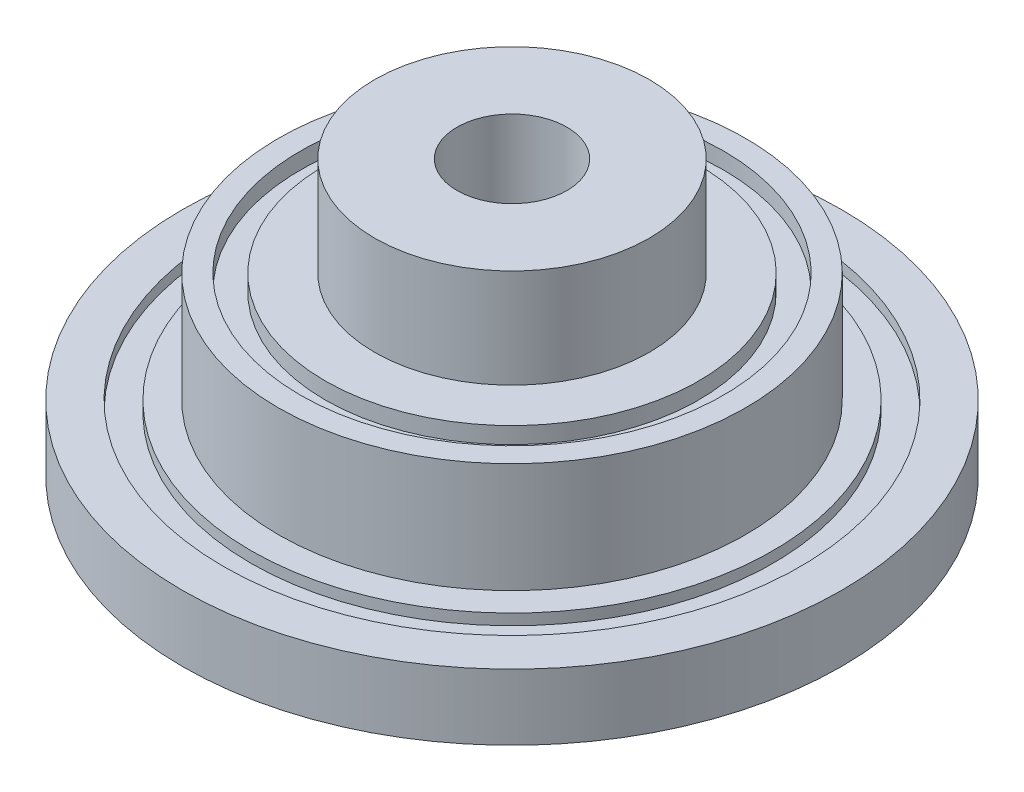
ISO-10303-21;
HEADER;
FILE_DESCRIPTION(('STEP AP214'),'2;1');
FILE_NAME('part.step','',(''),(''),'','','');
FILE_SCHEMA(('AUTOMOTIVE_DESIGN { 1 0 10303 214 1 1 1 1 }'));
ENDSEC;
DATA;
#1=APPLICATION_CONTEXT('core data for automotive mechanical design processes');
#2=APPLICATION_PROTOCOL_DEFINITION('international standard','automotive_design',2000,#1);
#3=PRODUCT_CONTEXT('',#1,'mechanical');
#4=PRODUCT('Part','Part','',(#3));
#5=PRODUCT_RELATED_PRODUCT_CATEGORY('part','',(#4));
#6=PRODUCT_DEFINITION_FORMATION('','',#4);
#7=PRODUCT_DEFINITION_CONTEXT('part definition',#1,'design');
#8=PRODUCT_DEFINITION('design','',#6,#7);
#9=PRODUCT_DEFINITION_SHAPE('','',#8);
#10=(LENGTH_UNIT() NAMED_UNIT(*) SI_UNIT(.MILLI.,.METRE.));
#11=(NAMED_UNIT(*) PLANE_ANGLE_UNIT() SI_UNIT($,.RADIAN.));
#12=(NAMED_UNIT(*) SI_UNIT($,.STERADIAN.) SOLID_ANGLE_UNIT());
#13=UNCERTAINTY_MEASURE_WITH_UNIT(LENGTH_MEASURE(1.E-05),#10,'distance_accuracy_value','');
#14=(GEOMETRIC_REPRESENTATION_CONTEXT(3) GLOBAL_UNCERTAINTY_ASSIGNED_CONTEXT((#13)) GLOBAL_UNIT_ASSIGNED_CONTEXT((#10,
#11,#12)) REPRESENTATION_CONTEXT('',''));
#15=CARTESIAN_POINT('',(0.,0.,0.));
#16=DIRECTION('',(0.,0.,1.));
#17=DIRECTION('',(1.,0.,0.));
#18=AXIS2_PLACEMENT_3D('',#15,#16,#17);
#19=CARTESIAN_POINT('',(0.,32.,0.));
#20=DIRECTION('',(0.,1.,0.));
#21=DIRECTION('',(0.,0.,1.));
#22=AXIS2_PLACEMENT_3D('',#19,#20,#21);
#23=PLANE('',#22);
#24=CARTESIAN_POINT('',(0.,32.,0.));
#25=DIRECTION('',(0.,1.,0.));
#26=DIRECTION('',(0.,0.,1.));
#27=AXIS2_PLACEMENT_3D('',#24,#25,#26);
#28=CIRCLE('',#27,34.);
#29=CARTESIAN_POINT('',(0.,32.,34.));
#30=VERTEX_POINT('',#29);
#31=EDGE_CURVE('E73',#30,#30,#28,.T.);
#32=ORIENTED_EDGE('',*,*,#31,.T.);
#33=EDGE_LOOP('',(#32));
#34=FACE_BOUND('',#33,.T.);
#35=CARTESIAN_POINT('',(0.,32.,0.));
#36=DIRECTION('',(0.,1.,0.));
#37=DIRECTION('',(0.,0.,1.));
#38=AXIS2_PLACEMENT_3D('',#35,#36,#37);
#39=CIRCLE('',#38,25.);
#40=CARTESIAN_POINT('',(0.,32.,25.));
#41=VERTEX_POINT('',#40);
#42=EDGE_CURVE('E79',#41,#41,#39,.T.);
#43=ORIENTED_EDGE('',*,*,#42,.F.);
#44=EDGE_LOOP('',(#43));
#45=FACE_BOUND('',#44,.T.);
#46=ADVANCED_FACE('F32',(#34,#45),#23,.T.);
#47=CARTESIAN_POINT('',(0.,12.,0.));
#48=DIRECTION('',(0.,1.,0.));
#49=DIRECTION('',(0.,0.,1.));
#50=AXIS2_PLACEMENT_3D('',#47,#48,#49);
#51=PLANE('',#50);
#52=CARTESIAN_POINT('',(0.,12.,0.));
#53=DIRECTION('',(0.,1.,0.));
#54=DIRECTION('',(0.,0.,1.));
#55=AXIS2_PLACEMENT_3D('',#52,#53,#54);
#56=CIRCLE('',#55,47.5);
#57=CARTESIAN_POINT('',(0.,12.,47.5));
#58=VERTEX_POINT('',#57);
#59=EDGE_CURVE('E55',#58,#58,#56,.T.);
#60=ORIENTED_EDGE('',*,*,#59,.T.);
#61=EDGE_LOOP('',(#60));
#62=FACE_BOUND('',#61,.T.);
#63=CARTESIAN_POINT('',(0.,12.,0.));
#64=DIRECTION('',(0.,1.,0.));
#65=DIRECTION('',(0.,0.,1.));
#66=AXIS2_PLACEMENT_3D('',#63,#64,#65);
#67=CIRCLE('',#66,42.5);
#68=CARTESIAN_POINT('',(0.,12.,42.5));
#69=VERTEX_POINT('',#68);
#70=EDGE_CURVE('E61',#69,#69,#67,.T.);
#71=ORIENTED_EDGE('',*,*,#70,.F.);
#72=EDGE_LOOP('',(#71));
#73=FACE_BOUND('',#72,.T.);
#74=ADVANCED_FACE('F111',(#62,#73),#51,.T.);
#75=CARTESIAN_POINT('',(0.,12.,0.));
#76=DIRECTION('',(0.,-1.,0.));
#77=DIRECTION('',(0.,0.,-1.));
#78=AXIS2_PLACEMENT_3D('',#75,#76,#77);
#79=CYLINDRICAL_SURFACE('',#78,60.);
#80=CARTESIAN_POINT('',(0.,12.,0.));
#81=DIRECTION('',(0.,1.,0.));
#82=DIRECTION('',(0.,0.,1.));
#83=AXIS2_PLACEMENT_3D('',#80,#81,#82);
#84=CIRCLE('',#83,60.);
#85=CARTESIAN_POINT('',(0.,12.,60.));
#86=VERTEX_POINT('',#85);
#87=EDGE_CURVE('E10',#86,#86,#84,.T.);
#88=ORIENTED_EDGE('',*,*,#87,.F.);
#89=EDGE_LOOP('',(#88));
#90=FACE_BOUND('',#89,.T.);
#91=CARTESIAN_POINT('',(0.,0.,0.));
#92=DIRECTION('',(0.,1.,0.));
#93=DIRECTION('',(0.,0.,1.));
#94=AXIS2_PLACEMENT_3D('',#91,#92,#93);
#95=CIRCLE('',#94,60.);
#96=CARTESIAN_POINT('',(0.,0.,60.));
#97=VERTEX_POINT('',#96);
#98=EDGE_CURVE('E39',#97,#97,#95,.T.);
#99=ORIENTED_EDGE('',*,*,#98,.T.);
#100=EDGE_LOOP('',(#99));
#101=FACE_BOUND('',#100,.T.);
#102=ADVANCED_FACE('F34',(#90,#101),#79,.T.);
#103=CARTESIAN_POINT('',(0.,12.,0.));
#104=DIRECTION('',(0.,1.,0.));
#105=DIRECTION('',(0.,0.,1.));
#106=AXIS2_PLACEMENT_3D('',#103,#104,#105);
#107=CIRCLE('',#106,52.5);
#108=CARTESIAN_POINT('',(0.,12.,52.5));
#109=VERTEX_POINT('',#108);
#110=EDGE_CURVE('E47',#109,#109,#107,.T.);
#111=ORIENTED_EDGE('',*,*,#110,.F.);
#112=EDGE_LOOP('',(#111));
#113=FACE_BOUND('',#112,.T.);
#114=ORIENTED_EDGE('',*,*,#87,.T.);
#115=EDGE_LOOP('',(#114));
#116=FACE_BOUND('',#115,.T.);
#117=ADVANCED_FACE('F119',(#113,#116),#51,.T.);
#118=CARTESIAN_POINT('',(0.,0.,0.));
#119=DIRECTION('',(0.,1.,0.));
#120=DIRECTION('',(0.,0.,1.));
#121=AXIS2_PLACEMENT_3D('',#118,#119,#120);
#122=PLANE('',#121);
#123=ORIENTED_EDGE('',*,*,#98,.F.);
#124=EDGE_LOOP('',(#123));
#125=FACE_BOUND('',#124,.T.);
#126=ADVANCED_FACE('F154',(#125),#122,.F.);
#127=CARTESIAN_POINT('',(0.,10.,0.));
#128=DIRECTION('',(0.,1.,0.));
#129=DIRECTION('',(0.,0.,1.));
#130=AXIS2_PLACEMENT_3D('',#127,#128,#129);
#131=CYLINDRICAL_SURFACE('',#130,52.5);
#132=CARTESIAN_POINT('',(0.,10.,0.));
#133=DIRECTION('',(0.,1.,0.));
#134=DIRECTION('',(0.,0.,1.));
#135=AXIS2_PLACEMENT_3D('',#132,#133,#134);
#136=CIRCLE('',#135,52.5);
#137=CARTESIAN_POINT('',(0.,10.,52.5));
#138=VERTEX_POINT('',#137);
#139=EDGE_CURVE('E43',#138,#138,#136,.T.);
#140=ORIENTED_EDGE('',*,*,#139,.F.);
#141=EDGE_LOOP('',(#140));
#142=FACE_BOUND('',#141,.T.);
#143=ORIENTED_EDGE('',*,*,#110,.T.);
#144=EDGE_LOOP('',(#143));
#145=FACE_BOUND('',#144,.T.);
#146=ADVANCED_FACE('F150',(#142,#145),#131,.F.);
#147=CARTESIAN_POINT('',(0.,10.,0.));
#148=DIRECTION('',(0.,1.,0.));
#149=DIRECTION('',(0.,0.,1.));
#150=AXIS2_PLACEMENT_3D('',#147,#148,#149);
#151=PLANE('',#150);
#152=CARTESIAN_POINT('',(0.,10.,0.));
#153=DIRECTION('',(0.,1.,0.));
#154=DIRECTION('',(0.,0.,1.));
#155=AXIS2_PLACEMENT_3D('',#152,#153,#154);
#156=CIRCLE('',#155,47.5);
#157=CARTESIAN_POINT('',(0.,10.,47.5));
#158=VERTEX_POINT('',#157);
#159=EDGE_CURVE('E52',#158,#158,#156,.T.);
#160=ORIENTED_EDGE('',*,*,#159,.F.);
#161=EDGE_LOOP('',(#160));
#162=FACE_BOUND('',#161,.T.);
#163=ORIENTED_EDGE('',*,*,#139,.T.);
#164=EDGE_LOOP('',(#163));
#165=FACE_BOUND('',#164,.T.);
#166=ADVANCED_FACE('F144',(#162,#165),#151,.T.);
#167=CARTESIAN_POINT('',(0.,10.,0.));
#168=DIRECTION('',(0.,1.,0.));
#169=DIRECTION('',(0.,0.,1.));
#170=AXIS2_PLACEMENT_3D('',#167,#168,#169);
#171=CYLINDRICAL_SURFACE('',#170,47.5);
#172=ORIENTED_EDGE('',*,*,#159,.T.);
#173=EDGE_LOOP('',(#172));
#174=FACE_BOUND('',#173,.T.);
#175=ORIENTED_EDGE('',*,*,#59,.F.);
#176=EDGE_LOOP('',(#175));
#177=FACE_BOUND('',#176,.T.);
#178=ADVANCED_FACE('F132',(#174,#177),#171,.T.);
#179=CARTESIAN_POINT('',(0.,32.,0.));
#180=DIRECTION('',(0.,-1.,0.));
#181=DIRECTION('',(0.,0.,-1.));
#182=AXIS2_PLACEMENT_3D('',#179,#180,#181);
#183=CYLINDRICAL_SURFACE('',#182,42.5);
#184=CARTESIAN_POINT('',(0.,32.,0.));
#185=DIRECTION('',(0.,1.,0.));
#186=DIRECTION('',(0.,0.,1.));
#187=AXIS2_PLACEMENT_3D('',#184,#185,#186);
#188=CIRCLE('',#187,42.5);
#189=CARTESIAN_POINT('',(0.,32.,42.5));
#190=VERTEX_POINT('',#189);
#191=EDGE_CURVE('E58',#190,#190,#188,.T.);
#192=ORIENTED_EDGE('',*,*,#191,.F.);
#193=EDGE_LOOP('',(#192));
#194=FACE_BOUND('',#193,.T.);
#195=ORIENTED_EDGE('',*,*,#70,.T.);
#196=EDGE_LOOP('',(#195));
#197=FACE_BOUND('',#196,.T.);
#198=ADVANCED_FACE('F124',(#194,#197),#183,.T.);
#199=CARTESIAN_POINT('',(0.,32.,0.));
#200=DIRECTION('',(0.,1.,0.));
#201=DIRECTION('',(0.,0.,1.));
#202=AXIS2_PLACEMENT_3D('',#199,#200,#201);
#203=CIRCLE('',#202,38.5);
#204=CARTESIAN_POINT('',(0.,32.,38.5));
#205=VERTEX_POINT('',#204);
#206=EDGE_CURVE('E67',#205,#205,#203,.T.);
#207=ORIENTED_EDGE('',*,*,#206,.F.);
#208=EDGE_LOOP('',(#207));
#209=FACE_BOUND('',#208,.T.);
#210=ORIENTED_EDGE('',*,*,#191,.T.);
#211=EDGE_LOOP('',(#210));
#212=FACE_BOUND('',#211,.T.);
#213=ADVANCED_FACE('F114',(#209,#212),#23,.T.);
#214=CARTESIAN_POINT('',(0.,29.,0.));
#215=DIRECTION('',(0.,1.,0.));
#216=DIRECTION('',(0.,0.,1.));
#217=AXIS2_PLACEMENT_3D('',#214,#215,#216);
#218=CYLINDRICAL_SURFACE('',#217,38.5);
#219=CARTESIAN_POINT('',(0.,29.,0.));
#220=DIRECTION('',(0.,1.,0.));
#221=DIRECTION('',(0.,0.,1.));
#222=AXIS2_PLACEMENT_3D('',#219,#220,#221);
#223=CIRCLE('',#222,38.5);
#224=CARTESIAN_POINT('',(0.,29.,38.5));
#225=VERTEX_POINT('',#224);
#226=EDGE_CURVE('E64',#225,#225,#223,.T.);
#227=ORIENTED_EDGE('',*,*,#226,.F.);
#228=EDGE_LOOP('',(#227));
#229=FACE_BOUND('',#228,.T.);
#230=ORIENTED_EDGE('',*,*,#206,.T.);
#231=EDGE_LOOP('',(#230));
#232=FACE_BOUND('',#231,.T.);
#233=ADVANCED_FACE('F123',(#229,#232),#218,.F.);
#234=CARTESIAN_POINT('',(0.,29.,0.));
#235=DIRECTION('',(0.,1.,0.));
#236=DIRECTION('',(0.,0.,1.));
#237=AXIS2_PLACEMENT_3D('',#234,#235,#236);
#238=PLANE('',#237);
#239=CARTESIAN_POINT('',(0.,29.,0.));
#240=DIRECTION('',(0.,1.,0.));
#241=DIRECTION('',(0.,0.,1.));
#242=AXIS2_PLACEMENT_3D('',#239,#240,#241);
#243=CIRCLE('',#242,34.);
#244=CARTESIAN_POINT('',(0.,29.,34.));
#245=VERTEX_POINT('',#244);
#246=EDGE_CURVE('E70',#245,#245,#243,.T.);
#247=ORIENTED_EDGE('',*,*,#246,.F.);
#248=EDGE_LOOP('',(#247));
#249=FACE_BOUND('',#248,.T.);
#250=ORIENTED_EDGE('',*,*,#226,.T.);
#251=EDGE_LOOP('',(#250));
#252=FACE_BOUND('',#251,.T.);
#253=ADVANCED_FACE('F130',(#249,#252),#238,.T.);
#254=CARTESIAN_POINT('',(0.,29.,0.));
#255=DIRECTION('',(0.,1.,0.));
#256=DIRECTION('',(0.,0.,1.));
#257=AXIS2_PLACEMENT_3D('',#254,#255,#256);
#258=CYLINDRICAL_SURFACE('',#257,34.);
#259=ORIENTED_EDGE('',*,*,#246,.T.);
#260=EDGE_LOOP('',(#259));
#261=FACE_BOUND('',#260,.T.);
#262=ORIENTED_EDGE('',*,*,#31,.F.);
#263=EDGE_LOOP('',(#262));
#264=FACE_BOUND('',#263,.T.);
#265=ADVANCED_FACE('F106',(#261,#264),#258,.T.);
#266=CARTESIAN_POINT('',(0.,50.,0.));
#267=DIRECTION('',(0.,-1.,0.));
#268=DIRECTION('',(0.,0.,-1.));
#269=AXIS2_PLACEMENT_3D('',#266,#267,#268);
#270=CYLINDRICAL_SURFACE('',#269,25.);
#271=CARTESIAN_POINT('',(0.,50.,0.));
#272=DIRECTION('',(0.,1.,0.));
#273=DIRECTION('',(0.,0.,1.));
#274=AXIS2_PLACEMENT_3D('',#271,#272,#273);
#275=CIRCLE('',#274,25.);
#276=CARTESIAN_POINT('',(0.,50.,25.));
#277=VERTEX_POINT('',#276);
#278=EDGE_CURVE('E76',#277,#277,#275,.T.);
#279=ORIENTED_EDGE('',*,*,#278,.F.);
#280=EDGE_LOOP('',(#279));
#281=FACE_BOUND('',#280,.T.);
#282=ORIENTED_EDGE('',*,*,#42,.T.);
#283=EDGE_LOOP('',(#282));
#284=FACE_BOUND('',#283,.T.);
#285=ADVANCED_FACE('F100',(#281,#284),#270,.T.);
#286=CARTESIAN_POINT('',(0.,50.,0.));
#287=DIRECTION('',(0.,1.,0.));
#288=DIRECTION('',(0.,0.,1.));
#289=AXIS2_PLACEMENT_3D('',#286,#287,#288);
#290=PLANE('',#289);
#291=CARTESIAN_POINT('',(0.,50.,0.));
#292=DIRECTION('',(0.,1.,0.));
#293=DIRECTION('',(0.,0.,1.));
#294=AXIS2_PLACEMENT_3D('',#291,#292,#293);
#295=CIRCLE('',#294,10.);
#296=CARTESIAN_POINT('',(0.,50.,10.));
#297=VERTEX_POINT('',#296);
#298=EDGE_CURVE('E83',#297,#297,#295,.T.);
#299=ORIENTED_EDGE('',*,*,#298,.F.);
#300=EDGE_LOOP('',(#299));
#301=FACE_BOUND('',#300,.T.);
#302=ORIENTED_EDGE('',*,*,#278,.T.);
#303=EDGE_LOOP('',(#302));
#304=FACE_BOUND('',#303,.T.);
#305=ADVANCED_FACE('F94',(#301,#304),#290,.T.);
#306=CARTESIAN_POINT('',(0.,12.0000000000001,0.));
#307=DIRECTION('',(0.,1.,0.));
#308=DIRECTION('',(0.,0.,1.));
#309=AXIS2_PLACEMENT_3D('',#306,#307,#308);
#310=CYLINDRICAL_SURFACE('',#309,10.);
#311=CARTESIAN_POINT('',(0.,12.0000000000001,0.));
#312=DIRECTION('',(0.,1.,0.));
#313=DIRECTION('',(0.,0.,1.));
#314=AXIS2_PLACEMENT_3D('',#311,#312,#313);
#315=CIRCLE('',#314,10.);
#316=CARTESIAN_POINT('',(0.,12.0000000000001,10.));
#317=VERTEX_POINT('',#316);
#318=EDGE_CURVE('E82',#317,#317,#315,.T.);
#319=ORIENTED_EDGE('',*,*,#318,.F.);
#320=EDGE_LOOP('',(#319));
#321=FACE_BOUND('',#320,.T.);
#322=ORIENTED_EDGE('',*,*,#298,.T.);
#323=EDGE_LOOP('',(#322));
#324=FACE_BOUND('',#323,.T.);
#325=ADVANCED_FACE('F91',(#321,#324),#310,.F.);
#326=CARTESIAN_POINT('',(0.,12.0000000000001,0.));
#327=DIRECTION('',(0.,1.,0.));
#328=DIRECTION('',(0.,0.,1.));
#329=AXIS2_PLACEMENT_3D('',#326,#327,#328);
#330=PLANE('',#329);
#331=ORIENTED_EDGE('',*,*,#318,.T.);
#332=EDGE_LOOP('',(#331));
#333=FACE_BOUND('',#332,.T.);
#334=ADVANCED_FACE('F89',(#333),#330,.T.);
#335=CLOSED_SHELL('',(#46,#74,#102,#117,#126,#146,#166,#178,#198,#213,#233,#253,#265,#285,#305,
#325,#334));
#336=MANIFOLD_SOLID_BREP('B2',#335);
#337=ADVANCED_BREP_SHAPE_REPRESENTATION('',(#18,#336),#14);
#338=SHAPE_DEFINITION_REPRESENTATION(#9,#337);
ENDSEC;
END-ISO-10303-21;
